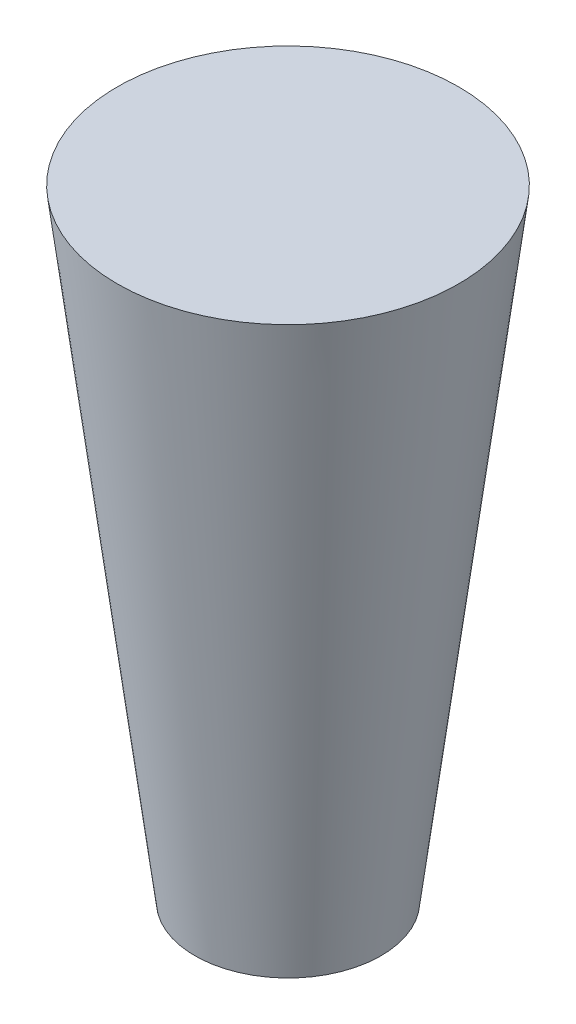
ISO-10303-21;
HEADER;
FILE_DESCRIPTION(('STEP AP214'),'2;1');
FILE_NAME('part.step','',(''),(''),'','','');
FILE_SCHEMA(('AUTOMOTIVE_DESIGN { 1 0 10303 214 1 1 1 1 }'));
ENDSEC;
DATA;
#1=APPLICATION_CONTEXT('core data for automotive mechanical design processes');
#2=APPLICATION_PROTOCOL_DEFINITION('international standard','automotive_design',2000,#1);
#3=PRODUCT_CONTEXT('',#1,'mechanical');
#4=PRODUCT('Part','Part','',(#3));
#5=PRODUCT_RELATED_PRODUCT_CATEGORY('part','',(#4));
#6=PRODUCT_DEFINITION_FORMATION('','',#4);
#7=PRODUCT_DEFINITION_CONTEXT('part definition',#1,'design');
#8=PRODUCT_DEFINITION('design','',#6,#7);
#9=PRODUCT_DEFINITION_SHAPE('','',#8);
#10=(LENGTH_UNIT() NAMED_UNIT(*) SI_UNIT(.MILLI.,.METRE.));
#11=(NAMED_UNIT(*) PLANE_ANGLE_UNIT() SI_UNIT($,.RADIAN.));
#12=(NAMED_UNIT(*) SI_UNIT($,.STERADIAN.) SOLID_ANGLE_UNIT());
#13=UNCERTAINTY_MEASURE_WITH_UNIT(LENGTH_MEASURE(1.E-05),#10,'distance_accuracy_value','');
#14=(GEOMETRIC_REPRESENTATION_CONTEXT(3) GLOBAL_UNCERTAINTY_ASSIGNED_CONTEXT((#13)) GLOBAL_UNIT_ASSIGNED_CONTEXT((#10,
#11,#12)) REPRESENTATION_CONTEXT('',''));
#15=CARTESIAN_POINT('',(0.,0.,0.));
#16=DIRECTION('',(0.,0.,1.));
#17=DIRECTION('',(1.,0.,0.));
#18=AXIS2_PLACEMENT_3D('',#15,#16,#17);
#19=CARTESIAN_POINT('',(0.,0.,0.));
#20=DIRECTION('',(0.,1.,0.));
#21=DIRECTION('',(0.,0.,1.));
#22=AXIS2_PLACEMENT_3D('',#19,#20,#21);
#23=PLANE('',#22);
#24=CARTESIAN_POINT('',(0.,0.,0.));
#25=DIRECTION('',(0.,-1.,0.));
#26=DIRECTION('',(0.,0.,-1.));
#27=AXIS2_PLACEMENT_3D('',#24,#25,#26);
#28=CIRCLE('',#27,2.38125);
#29=CARTESIAN_POINT('',(0.,0.,-2.38125));
#30=VERTEX_POINT('',#29);
#31=EDGE_CURVE('E10',#30,#30,#28,.T.);
#32=ORIENTED_EDGE('',*,*,#31,.T.);
#33=EDGE_LOOP('',(#32));
#34=FACE_BOUND('',#33,.T.);
#35=ADVANCED_FACE('F30',(#34),#23,.F.);
#36=CARTESIAN_POINT('',(0.,15.875,0.));
#37=DIRECTION('',(0.,1.,0.));
#38=DIRECTION('',(0.,0.,1.));
#39=AXIS2_PLACEMENT_3D('',#36,#37,#38);
#40=CONICAL_SURFACE('',#39,4.365625,0.124354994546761);
#41=ORIENTED_EDGE('',*,*,#31,.F.);
#42=EDGE_LOOP('',(#41));
#43=FACE_BOUND('',#42,.T.);
#44=CARTESIAN_POINT('',(0.,15.875,0.));
#45=DIRECTION('',(0.,-1.,0.));
#46=DIRECTION('',(0.,0.,-1.));
#47=AXIS2_PLACEMENT_3D('',#44,#45,#46);
#48=CIRCLE('',#47,4.365625);
#49=CARTESIAN_POINT('',(0.,15.875,-4.365625));
#50=VERTEX_POINT('',#49);
#51=EDGE_CURVE('E36',#50,#50,#48,.T.);
#52=ORIENTED_EDGE('',*,*,#51,.T.);
#53=EDGE_LOOP('',(#52));
#54=FACE_BOUND('',#53,.T.);
#55=ADVANCED_FACE('F42',(#43,#54),#40,.T.);
#56=CARTESIAN_POINT('',(-4.365625,15.875,0.));
#57=DIRECTION('',(0.,-1.,0.));
#58=DIRECTION('',(0.,0.,-1.));
#59=AXIS2_PLACEMENT_3D('',#56,#57,#58);
#60=PLANE('',#59);
#61=ORIENTED_EDGE('',*,*,#51,.F.);
#62=EDGE_LOOP('',(#61));
#63=FACE_BOUND('',#62,.T.);
#64=ADVANCED_FACE('F44',(#63),#60,.F.);
#65=CLOSED_SHELL('',(#35,#55,#64));
#66=MANIFOLD_SOLID_BREP('B2',#65);
#67=ADVANCED_BREP_SHAPE_REPRESENTATION('',(#18,#66),#14);
#68=SHAPE_DEFINITION_REPRESENTATION(#9,#67);
ENDSEC;
END-ISO-10303-21;
